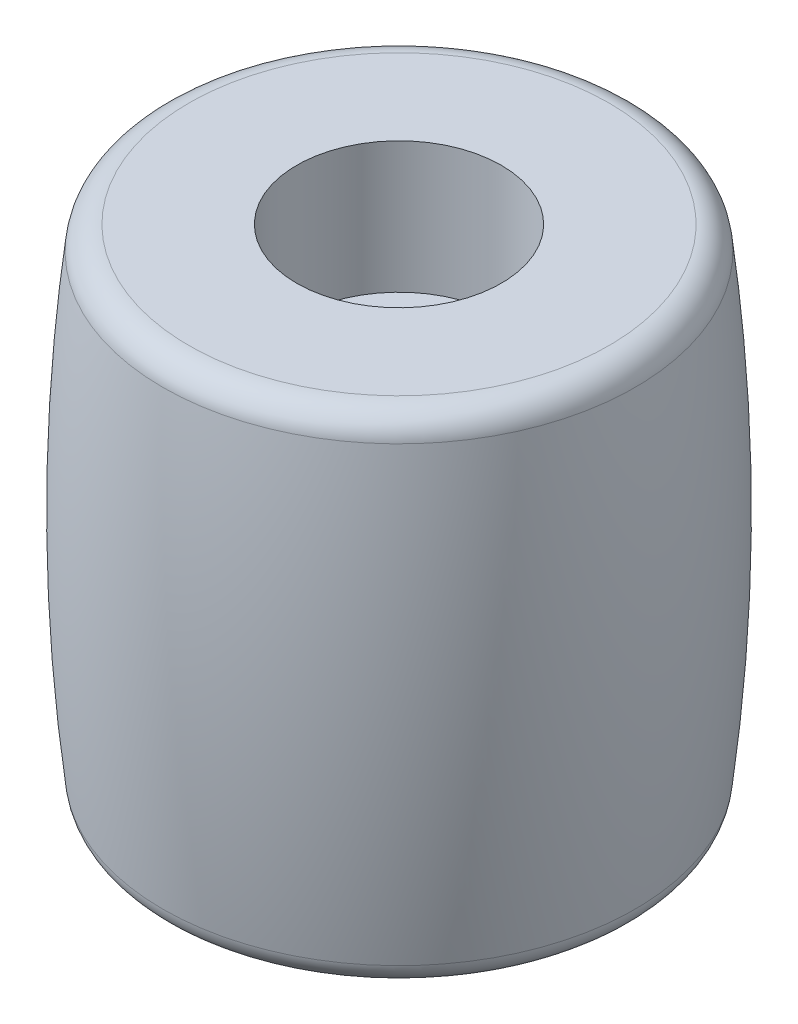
ISO-10303-21;
HEADER;
FILE_DESCRIPTION(('STEP AP214'),'2;1');
FILE_NAME('part.step','',(''),(''),'','','');
FILE_SCHEMA(('AUTOMOTIVE_DESIGN { 1 0 10303 214 1 1 1 1 }'));
ENDSEC;
DATA;
#1=APPLICATION_CONTEXT('core data for automotive mechanical design processes');
#2=APPLICATION_PROTOCOL_DEFINITION('international standard','automotive_design',2000,#1);
#3=PRODUCT_CONTEXT('',#1,'mechanical');
#4=PRODUCT('Part','Part','',(#3));
#5=PRODUCT_RELATED_PRODUCT_CATEGORY('part','',(#4));
#6=PRODUCT_DEFINITION_FORMATION('','',#4);
#7=PRODUCT_DEFINITION_CONTEXT('part definition',#1,'design');
#8=PRODUCT_DEFINITION('design','',#6,#7);
#9=PRODUCT_DEFINITION_SHAPE('','',#8);
#10=(LENGTH_UNIT() NAMED_UNIT(*) SI_UNIT(.MILLI.,.METRE.));
#11=(NAMED_UNIT(*) PLANE_ANGLE_UNIT() SI_UNIT($,.RADIAN.));
#12=(NAMED_UNIT(*) SI_UNIT($,.STERADIAN.) SOLID_ANGLE_UNIT());
#13=UNCERTAINTY_MEASURE_WITH_UNIT(LENGTH_MEASURE(1.E-05),#10,'distance_accuracy_value','');
#14=(GEOMETRIC_REPRESENTATION_CONTEXT(3) GLOBAL_UNCERTAINTY_ASSIGNED_CONTEXT((#13)) GLOBAL_UNIT_ASSIGNED_CONTEXT((#10,
#11,#12)) REPRESENTATION_CONTEXT('',''));
#15=CARTESIAN_POINT('',(0.,0.,0.));
#16=DIRECTION('',(0.,0.,1.));
#17=DIRECTION('',(1.,0.,0.));
#18=AXIS2_PLACEMENT_3D('',#15,#16,#17);
#19=CARTESIAN_POINT('',(0.,4.5,0.));
#20=DIRECTION('',(0.,-1.,0.));
#21=DIRECTION('',(0.,0.,-1.));
#22=AXIS2_PLACEMENT_3D('',#19,#20,#21);
#23=PLANE('',#22);
#24=CARTESIAN_POINT('',(0.,4.5,0.));
#25=DIRECTION('',(0.,-1.,0.));
#26=DIRECTION('',(0.,0.,-1.));
#27=AXIS2_PLACEMENT_3D('',#24,#25,#26);
#28=CIRCLE('',#27,2.5);
#29=CARTESIAN_POINT('',(0.,4.5,-2.5));
#30=VERTEX_POINT('',#29);
#31=EDGE_CURVE('E38',#30,#30,#28,.T.);
#32=ORIENTED_EDGE('',*,*,#31,.T.);
#33=EDGE_LOOP('',(#32));
#34=FACE_BOUND('',#33,.T.);
#35=CARTESIAN_POINT('',(0.,4.5,0.));
#36=DIRECTION('',(0.,-1.,0.));
#37=DIRECTION('',(0.,0.,-1.));
#38=AXIS2_PLACEMENT_3D('',#35,#36,#37);
#39=CIRCLE('',#38,3.9);
#40=CARTESIAN_POINT('',(0.,4.5,-3.9));
#41=VERTEX_POINT('',#40);
#42=EDGE_CURVE('E44',#41,#41,#39,.T.);
#43=ORIENTED_EDGE('',*,*,#42,.F.);
#44=EDGE_LOOP('',(#43));
#45=FACE_BOUND('',#44,.T.);
#46=ADVANCED_FACE('F15',(#34,#45),#23,.F.);
#47=CARTESIAN_POINT('',(0.,-4.5,0.));
#48=DIRECTION('',(0.,-1.,0.));
#49=DIRECTION('',(0.,0.,-1.));
#50=AXIS2_PLACEMENT_3D('',#47,#48,#49);
#51=PLANE('',#50);
#52=CARTESIAN_POINT('',(0.,-4.5,0.));
#53=DIRECTION('',(0.,-1.,0.));
#54=DIRECTION('',(0.,0.,-1.));
#55=AXIS2_PLACEMENT_3D('',#52,#53,#54);
#56=CIRCLE('',#55,2.5);
#57=CARTESIAN_POINT('',(0.,-4.5,-2.5));
#58=VERTEX_POINT('',#57);
#59=EDGE_CURVE('E31',#58,#58,#56,.T.);
#60=ORIENTED_EDGE('',*,*,#59,.F.);
#61=EDGE_LOOP('',(#60));
#62=FACE_BOUND('',#61,.T.);
#63=CARTESIAN_POINT('',(0.,-4.5,0.));
#64=DIRECTION('',(0.,-1.,0.));
#65=DIRECTION('',(0.,0.,-1.));
#66=AXIS2_PLACEMENT_3D('',#63,#64,#65);
#67=CIRCLE('',#66,3.9);
#68=CARTESIAN_POINT('',(0.,-4.5,-3.9));
#69=VERTEX_POINT('',#68);
#70=EDGE_CURVE('E22',#69,#69,#67,.T.);
#71=ORIENTED_EDGE('',*,*,#70,.T.);
#72=EDGE_LOOP('',(#71));
#73=FACE_BOUND('',#72,.T.);
#74=ADVANCED_FACE('F88',(#62,#73),#51,.T.);
#75=CARTESIAN_POINT('',(0.,-9.5,0.));
#76=DIRECTION('',(0.,-1.,0.));
#77=DIRECTION('',(0.,0.,-1.));
#78=AXIS2_PLACEMENT_3D('',#75,#76,#77);
#79=PLANE('',#78);
#80=CARTESIAN_POINT('',(0.,-9.5,0.));
#81=DIRECTION('',(0.,-1.,0.));
#82=DIRECTION('',(0.,0.,-1.));
#83=AXIS2_PLACEMENT_3D('',#80,#81,#82);
#84=CIRCLE('',#83,3.9);
#85=CARTESIAN_POINT('',(0.,-9.5,-3.9));
#86=VERTEX_POINT('',#85);
#87=EDGE_CURVE('E10',#86,#86,#84,.T.);
#88=ORIENTED_EDGE('',*,*,#87,.F.);
#89=EDGE_LOOP('',(#88));
#90=FACE_BOUND('',#89,.T.);
#91=CARTESIAN_POINT('',(0.,-9.5,0.));
#92=DIRECTION('',(0.,-1.,0.));
#93=DIRECTION('',(0.,0.,-1.));
#94=AXIS2_PLACEMENT_3D('',#91,#92,#93);
#95=CIRCLE('',#94,8.01020337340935);
#96=CARTESIAN_POINT('',(0.,-9.5,-8.01020337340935));
#97=VERTEX_POINT('',#96);
#98=EDGE_CURVE('E45',#97,#97,#95,.T.);
#99=ORIENTED_EDGE('',*,*,#98,.T.);
#100=EDGE_LOOP('',(#99));
#101=FACE_BOUND('',#100,.T.);
#102=ADVANCED_FACE('F93',(#90,#101),#79,.T.);
#103=CARTESIAN_POINT('',(0.,9.5,0.));
#104=DIRECTION('',(0.,-1.,0.));
#105=DIRECTION('',(0.,0.,-1.));
#106=AXIS2_PLACEMENT_3D('',#103,#104,#105);
#107=PLANE('',#106);
#108=CARTESIAN_POINT('',(0.,9.5,0.));
#109=DIRECTION('',(0.,-1.,0.));
#110=DIRECTION('',(0.,0.,-1.));
#111=AXIS2_PLACEMENT_3D('',#108,#109,#110);
#112=CIRCLE('',#111,3.9);
#113=CARTESIAN_POINT('',(0.,9.5,-3.9));
#114=VERTEX_POINT('',#113);
#115=EDGE_CURVE('E49',#114,#114,#112,.T.);
#116=ORIENTED_EDGE('',*,*,#115,.T.);
#117=EDGE_LOOP('',(#116));
#118=FACE_BOUND('',#117,.T.);
#119=CARTESIAN_POINT('',(0.,9.5,0.));
#120=DIRECTION('',(0.,1.,0.));
#121=DIRECTION('',(0.,0.,-1.));
#122=AXIS2_PLACEMENT_3D('',#119,#120,#121);
#123=CIRCLE('',#122,8.01020337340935);
#124=CARTESIAN_POINT('',(0.,9.5,-8.01020337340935));
#125=VERTEX_POINT('',#124);
#126=EDGE_CURVE('E64',#125,#125,#123,.T.);
#127=ORIENTED_EDGE('',*,*,#126,.T.);
#128=EDGE_LOOP('',(#127));
#129=FACE_BOUND('',#128,.T.);
#130=ADVANCED_FACE('F71',(#118,#129),#107,.F.);
#131=CARTESIAN_POINT('',(0.,0.,0.));
#132=DIRECTION('',(0.,-1.,0.));
#133=DIRECTION('',(0.,0.,1.));
#134=AXIS2_PLACEMENT_3D('',#131,#132,#133);
#135=DEGENERATE_TOROIDAL_SURFACE('',#134,65.5,75.,.F.);
#136=CARTESIAN_POINT('',(0.,-8.61486486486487,0.));
#137=DIRECTION('',(0.,1.,0.));
#138=DIRECTION('',(0.,0.,1.));
#139=AXIS2_PLACEMENT_3D('',#136,#137,#138);
#140=CIRCLE('',#139,9.00358450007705);
#141=CARTESIAN_POINT('',(0.,-8.61486486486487,9.00358450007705));
#142=VERTEX_POINT('',#141);
#143=EDGE_CURVE('E50',#142,#142,#140,.T.);
#144=ORIENTED_EDGE('',*,*,#143,.T.);
#145=EDGE_LOOP('',(#144));
#146=FACE_BOUND('',#145,.T.);
#147=CARTESIAN_POINT('',(0.,8.61486486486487,0.));
#148=DIRECTION('',(0.,-1.,0.));
#149=DIRECTION('',(0.,0.,-1.));
#150=AXIS2_PLACEMENT_3D('',#147,#148,#149);
#151=CIRCLE('',#150,9.00358450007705);
#152=CARTESIAN_POINT('',(0.,8.61486486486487,-9.00358450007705));
#153=VERTEX_POINT('',#152);
#154=EDGE_CURVE('E54',#153,#153,#151,.T.);
#155=ORIENTED_EDGE('',*,*,#154,.T.);
#156=EDGE_LOOP('',(#155));
#157=FACE_BOUND('',#156,.T.);
#158=ADVANCED_FACE('F106',(#146,#157),#135,.F.);
#159=CARTESIAN_POINT('',(0.,0.,0.));
#160=DIRECTION('',(0.,-1.,0.));
#161=DIRECTION('',(0.,0.,-1.));
#162=AXIS2_PLACEMENT_3D('',#159,#160,#161);
#163=CYLINDRICAL_SURFACE('',#162,3.9);
#164=ORIENTED_EDGE('',*,*,#87,.T.);
#165=EDGE_LOOP('',(#164));
#166=FACE_BOUND('',#165,.T.);
#167=ORIENTED_EDGE('',*,*,#70,.F.);
#168=EDGE_LOOP('',(#167));
#169=FACE_BOUND('',#168,.T.);
#170=ADVANCED_FACE('F111',(#166,#169),#163,.F.);
#171=CARTESIAN_POINT('',(0.,0.,0.));
#172=DIRECTION('',(0.,-1.,0.));
#173=DIRECTION('',(0.,0.,-1.));
#174=AXIS2_PLACEMENT_3D('',#171,#172,#173);
#175=CYLINDRICAL_SURFACE('',#174,2.5);
#176=ORIENTED_EDGE('',*,*,#59,.T.);
#177=EDGE_LOOP('',(#176));
#178=FACE_BOUND('',#177,.T.);
#179=ORIENTED_EDGE('',*,*,#31,.F.);
#180=EDGE_LOOP('',(#179));
#181=FACE_BOUND('',#180,.T.);
#182=ADVANCED_FACE('F101',(#178,#181),#175,.F.);
#183=CARTESIAN_POINT('',(0.,0.,0.));
#184=DIRECTION('',(0.,-1.,0.));
#185=DIRECTION('',(0.,0.,-1.));
#186=AXIS2_PLACEMENT_3D('',#183,#184,#185);
#187=CYLINDRICAL_SURFACE('',#186,3.9);
#188=ORIENTED_EDGE('',*,*,#42,.T.);
#189=EDGE_LOOP('',(#188));
#190=FACE_BOUND('',#189,.T.);
#191=ORIENTED_EDGE('',*,*,#115,.F.);
#192=EDGE_LOOP('',(#191));
#193=FACE_BOUND('',#192,.T.);
#194=ADVANCED_FACE('F82',(#190,#193),#187,.F.);
#195=CARTESIAN_POINT('',(0.,-8.5,0.));
#196=DIRECTION('',(0.,-1.,0.));
#197=DIRECTION('',(0.,0.,-1.));
#198=AXIS2_PLACEMENT_3D('',#195,#196,#197);
#199=TOROIDAL_SURFACE('',#198,8.01020337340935,1.);
#200=ORIENTED_EDGE('',*,*,#98,.F.);
#201=EDGE_LOOP('',(#200));
#202=FACE_BOUND('',#201,.T.);
#203=ORIENTED_EDGE('',*,*,#143,.F.);
#204=EDGE_LOOP('',(#203));
#205=FACE_BOUND('',#204,.T.);
#206=ADVANCED_FACE('F75',(#202,#205),#199,.T.);
#207=CARTESIAN_POINT('',(0.,8.5,0.));
#208=DIRECTION('',(0.,-1.,0.));
#209=DIRECTION('',(0.,0.,-1.));
#210=AXIS2_PLACEMENT_3D('',#207,#208,#209);
#211=TOROIDAL_SURFACE('',#210,8.01020337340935,1.);
#212=ORIENTED_EDGE('',*,*,#154,.F.);
#213=EDGE_LOOP('',(#212));
#214=FACE_BOUND('',#213,.T.);
#215=ORIENTED_EDGE('',*,*,#126,.F.);
#216=EDGE_LOOP('',(#215));
#217=FACE_BOUND('',#216,.T.);
#218=ADVANCED_FACE('F73',(#214,#217),#211,.T.);
#219=CLOSED_SHELL('',(#46,#74,#102,#130,#158,#170,#182,#194,#206,#218));
#220=MANIFOLD_SOLID_BREP('B1',#219);
#221=ADVANCED_BREP_SHAPE_REPRESENTATION('',(#18,#220),#14);
#222=SHAPE_DEFINITION_REPRESENTATION(#9,#221);
ENDSEC;
END-ISO-10303-21;
